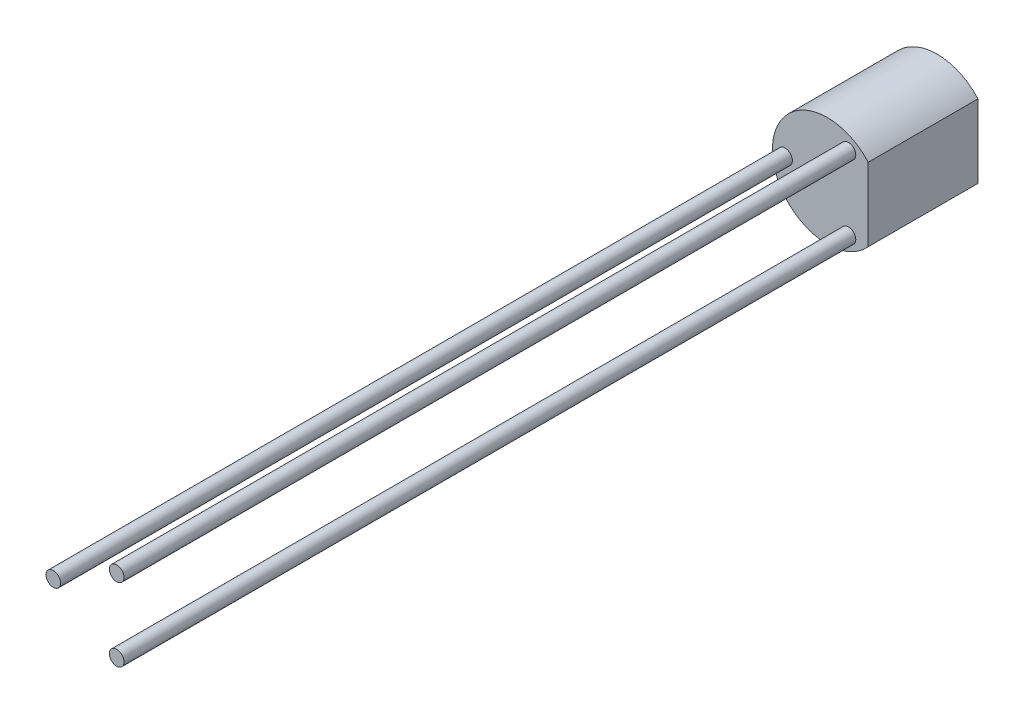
ISO-10303-21;
HEADER;
FILE_DESCRIPTION(('STEP AP214'),'2;1');
FILE_NAME('part.step','',(''),(''),'','','');
FILE_SCHEMA(('AUTOMOTIVE_DESIGN { 1 0 10303 214 1 1 1 1 }'));
ENDSEC;
DATA;
#1=APPLICATION_CONTEXT('core data for automotive mechanical design processes');
#2=APPLICATION_PROTOCOL_DEFINITION('international standard','automotive_design',2000,#1);
#3=PRODUCT_CONTEXT('',#1,'mechanical');
#4=PRODUCT('Part','Part','',(#3));
#5=PRODUCT_RELATED_PRODUCT_CATEGORY('part','',(#4));
#6=PRODUCT_DEFINITION_FORMATION('','',#4);
#7=PRODUCT_DEFINITION_CONTEXT('part definition',#1,'design');
#8=PRODUCT_DEFINITION('design','',#6,#7);
#9=PRODUCT_DEFINITION_SHAPE('','',#8);
#10=(LENGTH_UNIT() NAMED_UNIT(*) SI_UNIT(.MILLI.,.METRE.));
#11=(NAMED_UNIT(*) PLANE_ANGLE_UNIT() SI_UNIT($,.RADIAN.));
#12=(NAMED_UNIT(*) SI_UNIT($,.STERADIAN.) SOLID_ANGLE_UNIT());
#13=UNCERTAINTY_MEASURE_WITH_UNIT(LENGTH_MEASURE(1.E-05),#10,'distance_accuracy_value','');
#14=(GEOMETRIC_REPRESENTATION_CONTEXT(3) GLOBAL_UNCERTAINTY_ASSIGNED_CONTEXT((#13)) GLOBAL_UNIT_ASSIGNED_CONTEXT((#10,
#11,#12)) REPRESENTATION_CONTEXT('',''));
#15=CARTESIAN_POINT('',(0.,0.,0.));
#16=DIRECTION('',(0.,0.,1.));
#17=DIRECTION('',(1.,0.,0.));
#18=AXIS2_PLACEMENT_3D('',#15,#16,#17);
#19=CARTESIAN_POINT('',(0.020441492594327,0.,0.));
#20=DIRECTION('',(0.,0.,1.));
#21=DIRECTION('',(1.,0.,0.));
#22=AXIS2_PLACEMENT_3D('',#19,#20,#21);
#23=PLANE('',#22);
#24=DIRECTION('',(0.,1.,0.));
#25=VECTOR('',#24,1.);
#26=CARTESIAN_POINT('',(0.709951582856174,0.635,0.));
#27=LINE('',#26,#25);
#28=CARTESIAN_POINT('',(0.709951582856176,-0.635000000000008,0.));
#29=VERTEX_POINT('',#28);
#30=CARTESIAN_POINT('',(0.709951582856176,0.635000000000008,0.));
#31=VERTEX_POINT('',#30);
#32=EDGE_CURVE('E41',#29,#31,#27,.T.);
#33=ORIENTED_EDGE('',*,*,#32,.F.);
#34=CARTESIAN_POINT('',(0.,0.,0.));
#35=DIRECTION('',(0.,0.,1.));
#36=DIRECTION('',(1.,0.,0.));
#37=AXIS2_PLACEMENT_3D('',#34,#35,#36);
#38=CIRCLE('',#37,0.9525);
#39=EDGE_CURVE('E19',#31,#29,#38,.T.);
#40=ORIENTED_EDGE('',*,*,#39,.F.);
#41=EDGE_LOOP('',(#33,#40));
#42=FACE_BOUND('',#41,.T.);
#43=ADVANCED_FACE('F16',(#42),#23,.F.);
#44=CARTESIAN_POINT('',(0.709951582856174,0.635,0.));
#45=DIRECTION('',(1.,0.,0.));
#46=DIRECTION('',(0.,0.,-1.));
#47=AXIS2_PLACEMENT_3D('',#44,#45,#46);
#48=PLANE('',#47);
#49=ORIENTED_EDGE('',*,*,#32,.T.);
#50=DIRECTION('',(0.,0.,1.));
#51=VECTOR('',#50,1.);
#52=CARTESIAN_POINT('',(0.709951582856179,0.635000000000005,0.));
#53=LINE('',#52,#51);
#54=CARTESIAN_POINT('',(0.709951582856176,0.635000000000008,1.905));
#55=VERTEX_POINT('',#54);
#56=EDGE_CURVE('E46',#55,#31,#53,.F.);
#57=ORIENTED_EDGE('',*,*,#56,.F.);
#58=DIRECTION('',(0.,1.,0.));
#59=VECTOR('',#58,1.);
#60=CARTESIAN_POINT('',(0.709951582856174,0.635,1.905));
#61=LINE('',#60,#59);
#62=CARTESIAN_POINT('',(0.709951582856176,-0.635000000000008,1.905));
#63=VERTEX_POINT('',#62);
#64=EDGE_CURVE('E33',#55,#63,#61,.F.);
#65=ORIENTED_EDGE('',*,*,#64,.T.);
#66=DIRECTION('',(0.,0.,1.));
#67=VECTOR('',#66,1.);
#68=CARTESIAN_POINT('',(0.709951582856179,-0.635000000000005,0.));
#69=LINE('',#68,#67);
#70=EDGE_CURVE('E49',#29,#63,#69,.T.);
#71=ORIENTED_EDGE('',*,*,#70,.F.);
#72=EDGE_LOOP('',(#49,#57,#65,#71));
#73=FACE_BOUND('',#72,.T.);
#74=ADVANCED_FACE('F50',(#73),#48,.T.);
#75=CARTESIAN_POINT('',(-0.733234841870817,0.,14.605));
#76=DIRECTION('',(0.,0.,-1.));
#77=DIRECTION('',(-1.,0.,0.));
#78=AXIS2_PLACEMENT_3D('',#75,#76,#77);
#79=PLANE('',#78);
#80=CARTESIAN_POINT('',(-0.733234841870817,0.,14.605));
#81=DIRECTION('',(0.,0.,1.));
#82=DIRECTION('',(1.,0.,0.));
#83=AXIS2_PLACEMENT_3D('',#80,#81,#82);
#84=CIRCLE('',#83,0.127);
#85=CARTESIAN_POINT('',(-0.606234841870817,0.,14.605));
#86=VERTEX_POINT('',#85);
#87=EDGE_CURVE('E53',#86,#86,#84,.F.);
#88=ORIENTED_EDGE('',*,*,#87,.F.);
#89=EDGE_LOOP('',(#88));
#90=FACE_BOUND('',#89,.T.);
#91=ADVANCED_FACE('F76',(#90),#79,.F.);
#92=CARTESIAN_POINT('',(0.366617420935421,0.635,14.605));
#93=DIRECTION('',(0.,0.,-1.));
#94=DIRECTION('',(-1.,0.,0.));
#95=AXIS2_PLACEMENT_3D('',#92,#93,#94);
#96=PLANE('',#95);
#97=CARTESIAN_POINT('',(0.366617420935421,0.635,14.605));
#98=DIRECTION('',(0.,0.,1.));
#99=DIRECTION('',(1.,0.,0.));
#100=AXIS2_PLACEMENT_3D('',#97,#98,#99);
#101=CIRCLE('',#100,0.127);
#102=CARTESIAN_POINT('',(0.493617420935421,0.635,14.605));
#103=VERTEX_POINT('',#102);
#104=EDGE_CURVE('E69',#103,#103,#101,.F.);
#105=ORIENTED_EDGE('',*,*,#104,.F.);
#106=EDGE_LOOP('',(#105));
#107=FACE_BOUND('',#106,.T.);
#108=ADVANCED_FACE('F78',(#107),#96,.F.);
#109=CARTESIAN_POINT('',(0.,0.,0.));
#110=DIRECTION('',(0.,0.,1.));
#111=DIRECTION('',(1.,0.,0.));
#112=AXIS2_PLACEMENT_3D('',#109,#110,#111);
#113=CYLINDRICAL_SURFACE('',#112,0.9525);
#114=ORIENTED_EDGE('',*,*,#39,.T.);
#115=ORIENTED_EDGE('',*,*,#70,.T.);
#116=CARTESIAN_POINT('',(0.,0.,1.905));
#117=DIRECTION('',(0.,0.,1.));
#118=DIRECTION('',(1.,0.,0.));
#119=AXIS2_PLACEMENT_3D('',#116,#117,#118);
#120=CIRCLE('',#119,0.9525);
#121=EDGE_CURVE('E67',#55,#63,#120,.T.);
#122=ORIENTED_EDGE('',*,*,#121,.F.);
#123=ORIENTED_EDGE('',*,*,#56,.T.);
#124=EDGE_LOOP('',(#114,#115,#122,#123));
#125=FACE_BOUND('',#124,.T.);
#126=ADVANCED_FACE('F55',(#125),#113,.T.);
#127=CARTESIAN_POINT('',(-0.733234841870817,0.,1.905));
#128=DIRECTION('',(0.,0.,1.));
#129=DIRECTION('',(1.,0.,0.));
#130=AXIS2_PLACEMENT_3D('',#127,#128,#129);
#131=CYLINDRICAL_SURFACE('',#130,0.127);
#132=CARTESIAN_POINT('',(-0.733234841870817,0.,1.905));
#133=DIRECTION('',(0.,0.,1.));
#134=DIRECTION('',(1.,0.,0.));
#135=AXIS2_PLACEMENT_3D('',#132,#133,#134);
#136=CIRCLE('',#135,0.127);
#137=CARTESIAN_POINT('',(-0.606234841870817,0.,1.905));
#138=VERTEX_POINT('',#137);
#139=EDGE_CURVE('E64',#138,#138,#136,.F.);
#140=ORIENTED_EDGE('',*,*,#139,.F.);
#141=EDGE_LOOP('',(#140));
#142=FACE_BOUND('',#141,.T.);
#143=ORIENTED_EDGE('',*,*,#87,.T.);
#144=EDGE_LOOP('',(#143));
#145=FACE_BOUND('',#144,.T.);
#146=ADVANCED_FACE('F74',(#142,#145),#131,.T.);
#147=CARTESIAN_POINT('',(0.366617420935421,0.635,1.905));
#148=DIRECTION('',(0.,0.,1.));
#149=DIRECTION('',(1.,0.,0.));
#150=AXIS2_PLACEMENT_3D('',#147,#148,#149);
#151=CYLINDRICAL_SURFACE('',#150,0.127);
#152=CARTESIAN_POINT('',(0.366617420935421,0.635,1.905));
#153=DIRECTION('',(0.,0.,1.));
#154=DIRECTION('',(1.,0.,0.));
#155=AXIS2_PLACEMENT_3D('',#152,#153,#154);
#156=CIRCLE('',#155,0.127);
#157=CARTESIAN_POINT('',(0.493617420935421,0.635,1.905));
#158=VERTEX_POINT('',#157);
#159=EDGE_CURVE('E61',#158,#158,#156,.F.);
#160=ORIENTED_EDGE('',*,*,#159,.F.);
#161=EDGE_LOOP('',(#160));
#162=FACE_BOUND('',#161,.T.);
#163=ORIENTED_EDGE('',*,*,#104,.T.);
#164=EDGE_LOOP('',(#163));
#165=FACE_BOUND('',#164,.T.);
#166=ADVANCED_FACE('F105',(#162,#165),#151,.T.);
#167=CARTESIAN_POINT('',(0.366617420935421,-0.635,14.605));
#168=DIRECTION('',(0.,0.,-1.));
#169=DIRECTION('',(-1.,0.,0.));
#170=AXIS2_PLACEMENT_3D('',#167,#168,#169);
#171=PLANE('',#170);
#172=CARTESIAN_POINT('',(0.366617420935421,-0.635,14.605));
#173=DIRECTION('',(0.,0.,1.));
#174=DIRECTION('',(1.,0.,0.));
#175=AXIS2_PLACEMENT_3D('',#172,#173,#174);
#176=CIRCLE('',#175,0.127);
#177=CARTESIAN_POINT('',(0.493617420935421,-0.635,14.605));
#178=VERTEX_POINT('',#177);
#179=EDGE_CURVE('E25',#178,#178,#176,.F.);
#180=ORIENTED_EDGE('',*,*,#179,.F.);
#181=EDGE_LOOP('',(#180));
#182=FACE_BOUND('',#181,.T.);
#183=ADVANCED_FACE('F98',(#182),#171,.F.);
#184=CARTESIAN_POINT('',(0.020441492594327,0.,1.905));
#185=DIRECTION('',(0.,0.,1.));
#186=DIRECTION('',(1.,0.,0.));
#187=AXIS2_PLACEMENT_3D('',#184,#185,#186);
#188=PLANE('',#187);
#189=ORIENTED_EDGE('',*,*,#159,.T.);
#190=EDGE_LOOP('',(#189));
#191=FACE_BOUND('',#190,.T.);
#192=ORIENTED_EDGE('',*,*,#139,.T.);
#193=EDGE_LOOP('',(#192));
#194=FACE_BOUND('',#193,.T.);
#195=CARTESIAN_POINT('',(0.366617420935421,-0.635,1.905));
#196=DIRECTION('',(0.,0.,1.));
#197=DIRECTION('',(1.,0.,0.));
#198=AXIS2_PLACEMENT_3D('',#195,#196,#197);
#199=CIRCLE('',#198,0.127);
#200=CARTESIAN_POINT('',(0.493617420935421,-0.635,1.905));
#201=VERTEX_POINT('',#200);
#202=EDGE_CURVE('E10',#201,#201,#199,.T.);
#203=ORIENTED_EDGE('',*,*,#202,.F.);
#204=EDGE_LOOP('',(#203));
#205=FACE_BOUND('',#204,.T.);
#206=ORIENTED_EDGE('',*,*,#64,.F.);
#207=ORIENTED_EDGE('',*,*,#121,.T.);
#208=EDGE_LOOP('',(#206,#207));
#209=FACE_BOUND('',#208,.T.);
#210=ADVANCED_FACE('F89',(#191,#194,#205,#209),#188,.T.);
#211=CARTESIAN_POINT('',(0.366617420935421,-0.635,1.905));
#212=DIRECTION('',(0.,0.,1.));
#213=DIRECTION('',(1.,0.,0.));
#214=AXIS2_PLACEMENT_3D('',#211,#212,#213);
#215=CYLINDRICAL_SURFACE('',#214,0.127);
#216=ORIENTED_EDGE('',*,*,#202,.T.);
#217=EDGE_LOOP('',(#216));
#218=FACE_BOUND('',#217,.T.);
#219=ORIENTED_EDGE('',*,*,#179,.T.);
#220=EDGE_LOOP('',(#219));
#221=FACE_BOUND('',#220,.T.);
#222=ADVANCED_FACE('F87',(#218,#221),#215,.T.);
#223=CLOSED_SHELL('',(#43,#74,#91,#108,#126,#146,#166,#183,#210,#222));
#224=MANIFOLD_SOLID_BREP('B1',#223);
#225=ADVANCED_BREP_SHAPE_REPRESENTATION('',(#18,#224),#14);
#226=SHAPE_DEFINITION_REPRESENTATION(#9,#225);
ENDSEC;
END-ISO-10303-21;
